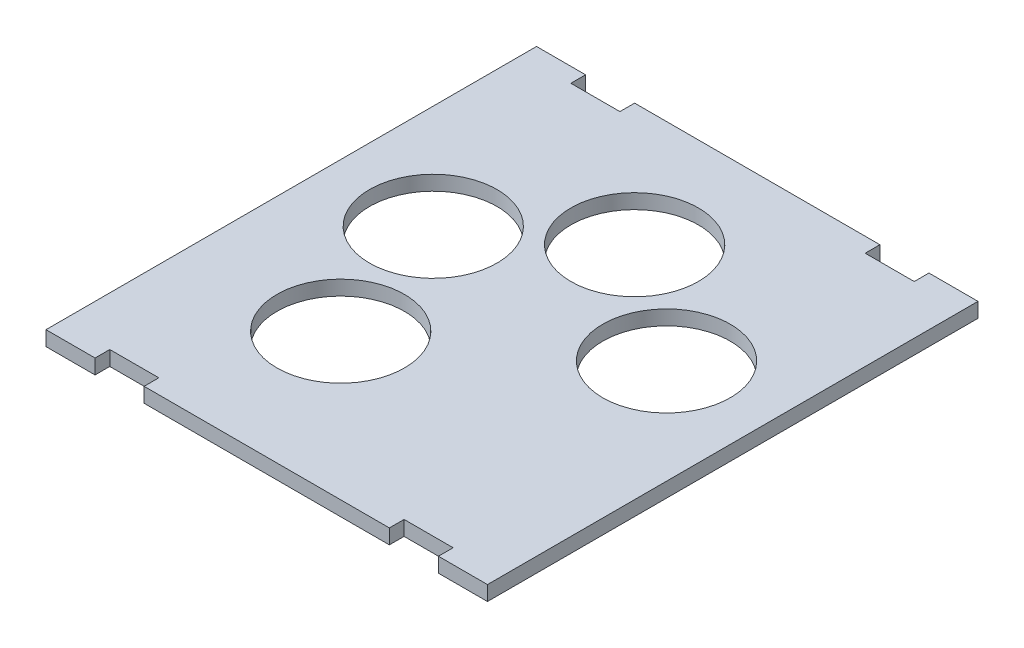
ISO-10303-21;
HEADER;
FILE_DESCRIPTION(('STEP AP214'),'2;1');
FILE_NAME('part.step','',(''),(''),'','','');
FILE_SCHEMA(('AUTOMOTIVE_DESIGN { 1 0 10303 214 1 1 1 1 }'));
ENDSEC;
DATA;
#1=APPLICATION_CONTEXT('core data for automotive mechanical design processes');
#2=APPLICATION_PROTOCOL_DEFINITION('international standard','automotive_design',2000,#1);
#3=PRODUCT_CONTEXT('',#1,'mechanical');
#4=PRODUCT('Part','Part','',(#3));
#5=PRODUCT_RELATED_PRODUCT_CATEGORY('part','',(#4));
#6=PRODUCT_DEFINITION_FORMATION('','',#4);
#7=PRODUCT_DEFINITION_CONTEXT('part definition',#1,'design');
#8=PRODUCT_DEFINITION('design','',#6,#7);
#9=PRODUCT_DEFINITION_SHAPE('','',#8);
#10=(LENGTH_UNIT() NAMED_UNIT(*) SI_UNIT(.MILLI.,.METRE.));
#11=(NAMED_UNIT(*) PLANE_ANGLE_UNIT() SI_UNIT($,.RADIAN.));
#12=(NAMED_UNIT(*) SI_UNIT($,.STERADIAN.) SOLID_ANGLE_UNIT());
#13=UNCERTAINTY_MEASURE_WITH_UNIT(LENGTH_MEASURE(1.E-05),#10,'distance_accuracy_value','');
#14=(GEOMETRIC_REPRESENTATION_CONTEXT(3) GLOBAL_UNCERTAINTY_ASSIGNED_CONTEXT((#13)) GLOBAL_UNIT_ASSIGNED_CONTEXT((#10,
#11,#12)) REPRESENTATION_CONTEXT('',''));
#15=CARTESIAN_POINT('',(0.,0.,0.));
#16=DIRECTION('',(0.,0.,1.));
#17=DIRECTION('',(1.,0.,0.));
#18=AXIS2_PLACEMENT_3D('',#15,#16,#17);
#19=CARTESIAN_POINT('',(45.,3.,-50.));
#20=DIRECTION('',(0.,0.,1.));
#21=DIRECTION('',(1.,0.,0.));
#22=AXIS2_PLACEMENT_3D('',#19,#20,#21);
#23=PLANE('',#22);
#24=DIRECTION('',(-1.,0.,0.));
#25=VECTOR('',#24,1.);
#26=CARTESIAN_POINT('',(45.,0.,-50.));
#27=LINE('',#26,#25);
#28=CARTESIAN_POINT('',(45.,0.,-50.));
#29=VERTEX_POINT('',#28);
#30=CARTESIAN_POINT('',(35.,0.,-50.));
#31=VERTEX_POINT('',#30);
#32=EDGE_CURVE('E320',#29,#31,#27,.T.);
#33=ORIENTED_EDGE('',*,*,#32,.T.);
#34=DIRECTION('',(0.,1.,0.));
#35=VECTOR('',#34,1.);
#36=CARTESIAN_POINT('',(35.,0.,-50.));
#37=LINE('',#36,#35);
#38=CARTESIAN_POINT('',(35.,3.,-50.));
#39=VERTEX_POINT('',#38);
#40=EDGE_CURVE('E202',#31,#39,#37,.T.);
#41=ORIENTED_EDGE('',*,*,#40,.T.);
#42=DIRECTION('',(-1.,0.,0.));
#43=VECTOR('',#42,1.);
#44=CARTESIAN_POINT('',(45.,3.,-50.));
#45=LINE('',#44,#43);
#46=CARTESIAN_POINT('',(45.,3.,-50.));
#47=VERTEX_POINT('',#46);
#48=EDGE_CURVE('E305',#47,#39,#45,.T.);
#49=ORIENTED_EDGE('',*,*,#48,.F.);
#50=DIRECTION('',(0.,-1.,0.));
#51=VECTOR('',#50,1.);
#52=CARTESIAN_POINT('',(45.,3.,-50.));
#53=LINE('',#52,#51);
#54=EDGE_CURVE('E319',#47,#29,#53,.T.);
#55=ORIENTED_EDGE('',*,*,#54,.T.);
#56=EDGE_LOOP('',(#33,#41,#49,#55));
#57=FACE_BOUND('',#56,.T.);
#58=ADVANCED_FACE('F32',(#57),#23,.F.);
#59=CARTESIAN_POINT('',(25.,3.,-50.));
#60=VERTEX_POINT('',#59);
#61=CARTESIAN_POINT('',(-25.,3.,-50.));
#62=VERTEX_POINT('',#61);
#63=EDGE_CURVE('E309',#60,#62,#45,.T.);
#64=ORIENTED_EDGE('',*,*,#63,.F.);
#65=DIRECTION('',(0.,1.,0.));
#66=VECTOR('',#65,1.);
#67=CARTESIAN_POINT('',(25.,0.,-50.));
#68=LINE('',#67,#66);
#69=CARTESIAN_POINT('',(25.,0.,-50.));
#70=VERTEX_POINT('',#69);
#71=EDGE_CURVE('E176',#70,#60,#68,.T.);
#72=ORIENTED_EDGE('',*,*,#71,.F.);
#73=CARTESIAN_POINT('',(-25.,0.,-50.));
#74=VERTEX_POINT('',#73);
#75=EDGE_CURVE('E192',#70,#74,#27,.T.);
#76=ORIENTED_EDGE('',*,*,#75,.T.);
#77=DIRECTION('',(0.,1.,0.));
#78=VECTOR('',#77,1.);
#79=CARTESIAN_POINT('',(-25.,0.,-50.));
#80=LINE('',#79,#78);
#81=EDGE_CURVE('E272',#74,#62,#80,.T.);
#82=ORIENTED_EDGE('',*,*,#81,.T.);
#83=EDGE_LOOP('',(#64,#72,#76,#82));
#84=FACE_BOUND('',#83,.T.);
#85=ADVANCED_FACE('F362',(#84),#23,.F.);
#86=CARTESIAN_POINT('',(-45.,3.,50.));
#87=DIRECTION('',(0.,0.,-1.));
#88=DIRECTION('',(-1.,0.,0.));
#89=AXIS2_PLACEMENT_3D('',#86,#87,#88);
#90=PLANE('',#89);
#91=DIRECTION('',(1.,0.,0.));
#92=VECTOR('',#91,1.);
#93=CARTESIAN_POINT('',(-45.,0.,50.));
#94=LINE('',#93,#92);
#95=CARTESIAN_POINT('',(-45.,0.,50.));
#96=VERTEX_POINT('',#95);
#97=CARTESIAN_POINT('',(-35.,0.,50.));
#98=VERTEX_POINT('',#97);
#99=EDGE_CURVE('E326',#96,#98,#94,.T.);
#100=ORIENTED_EDGE('',*,*,#99,.T.);
#101=DIRECTION('',(0.,1.,0.));
#102=VECTOR('',#101,1.);
#103=CARTESIAN_POINT('',(-35.,0.,50.));
#104=LINE('',#103,#102);
#105=CARTESIAN_POINT('',(-35.,3.,50.));
#106=VERTEX_POINT('',#105);
#107=EDGE_CURVE('E243',#98,#106,#104,.T.);
#108=ORIENTED_EDGE('',*,*,#107,.T.);
#109=DIRECTION('',(1.,0.,0.));
#110=VECTOR('',#109,1.);
#111=CARTESIAN_POINT('',(-45.,3.,50.));
#112=LINE('',#111,#110);
#113=CARTESIAN_POINT('',(-45.,3.,50.));
#114=VERTEX_POINT('',#113);
#115=EDGE_CURVE('E313',#114,#106,#112,.T.);
#116=ORIENTED_EDGE('',*,*,#115,.F.);
#117=DIRECTION('',(0.,-1.,0.));
#118=VECTOR('',#117,1.);
#119=CARTESIAN_POINT('',(-45.,3.,50.));
#120=LINE('',#119,#118);
#121=EDGE_CURVE('E40',#114,#96,#120,.T.);
#122=ORIENTED_EDGE('',*,*,#121,.T.);
#123=EDGE_LOOP('',(#100,#108,#116,#122));
#124=FACE_BOUND('',#123,.T.);
#125=ADVANCED_FACE('F341',(#124),#90,.F.);
#126=CARTESIAN_POINT('',(-25.,3.,50.));
#127=VERTEX_POINT('',#126);
#128=CARTESIAN_POINT('',(25.,3.,50.));
#129=VERTEX_POINT('',#128);
#130=EDGE_CURVE('E317',#127,#129,#112,.T.);
#131=ORIENTED_EDGE('',*,*,#130,.F.);
#132=DIRECTION('',(0.,1.,0.));
#133=VECTOR('',#132,1.);
#134=CARTESIAN_POINT('',(-25.,0.,50.));
#135=LINE('',#134,#133);
#136=CARTESIAN_POINT('',(-25.,0.,50.));
#137=VERTEX_POINT('',#136);
#138=EDGE_CURVE('E254',#137,#127,#135,.T.);
#139=ORIENTED_EDGE('',*,*,#138,.F.);
#140=CARTESIAN_POINT('',(25.,0.,50.));
#141=VERTEX_POINT('',#140);
#142=EDGE_CURVE('E330',#137,#141,#94,.T.);
#143=ORIENTED_EDGE('',*,*,#142,.T.);
#144=DIRECTION('',(0.,1.,0.));
#145=VECTOR('',#144,1.);
#146=CARTESIAN_POINT('',(25.,0.,50.));
#147=LINE('',#146,#145);
#148=EDGE_CURVE('E200',#141,#129,#147,.T.);
#149=ORIENTED_EDGE('',*,*,#148,.T.);
#150=EDGE_LOOP('',(#131,#139,#143,#149));
#151=FACE_BOUND('',#150,.T.);
#152=ADVANCED_FACE('F387',(#151),#90,.F.);
#153=CARTESIAN_POINT('',(0.,3.,0.));
#154=DIRECTION('',(0.,1.,0.));
#155=DIRECTION('',(0.,0.,1.));
#156=AXIS2_PLACEMENT_3D('',#153,#154,#155);
#157=PLANE('',#156);
#158=DIRECTION('',(0.,0.,1.));
#159=VECTOR('',#158,1.);
#160=CARTESIAN_POINT('',(-35.,3.,50.));
#161=LINE('',#160,#159);
#162=CARTESIAN_POINT('',(-35.,3.,47.));
#163=VERTEX_POINT('',#162);
#164=EDGE_CURVE('E244',#163,#106,#161,.T.);
#165=ORIENTED_EDGE('',*,*,#164,.F.);
#166=DIRECTION('',(-1.,0.,0.));
#167=VECTOR('',#166,1.);
#168=CARTESIAN_POINT('',(-35.,3.,47.));
#169=LINE('',#168,#167);
#170=CARTESIAN_POINT('',(-25.,3.,47.));
#171=VERTEX_POINT('',#170);
#172=EDGE_CURVE('E238',#171,#163,#169,.T.);
#173=ORIENTED_EDGE('',*,*,#172,.F.);
#174=DIRECTION('',(0.,0.,-1.));
#175=VECTOR('',#174,1.);
#176=CARTESIAN_POINT('',(-25.,3.,47.));
#177=LINE('',#176,#175);
#178=EDGE_CURVE('E246',#127,#171,#177,.T.);
#179=ORIENTED_EDGE('',*,*,#178,.F.);
#180=ORIENTED_EDGE('',*,*,#130,.T.);
#181=DIRECTION('',(0.,0.,1.));
#182=VECTOR('',#181,1.);
#183=CARTESIAN_POINT('',(25.,3.,50.));
#184=LINE('',#183,#182);
#185=CARTESIAN_POINT('',(25.,3.,47.));
#186=VERTEX_POINT('',#185);
#187=EDGE_CURVE('E212',#186,#129,#184,.T.);
#188=ORIENTED_EDGE('',*,*,#187,.F.);
#189=DIRECTION('',(-1.,0.,0.));
#190=VECTOR('',#189,1.);
#191=CARTESIAN_POINT('',(25.,3.,47.));
#192=LINE('',#191,#190);
#193=CARTESIAN_POINT('',(35.,3.,47.));
#194=VERTEX_POINT('',#193);
#195=EDGE_CURVE('E222',#194,#186,#192,.T.);
#196=ORIENTED_EDGE('',*,*,#195,.F.);
#197=DIRECTION('',(0.,0.,-1.));
#198=VECTOR('',#197,1.);
#199=CARTESIAN_POINT('',(35.,3.,47.));
#200=LINE('',#199,#198);
#201=CARTESIAN_POINT('',(35.,3.,50.));
#202=VERTEX_POINT('',#201);
#203=EDGE_CURVE('E219',#202,#194,#200,.T.);
#204=ORIENTED_EDGE('',*,*,#203,.F.);
#205=CARTESIAN_POINT('',(45.,3.,50.));
#206=VERTEX_POINT('',#205);
#207=EDGE_CURVE('E312',#202,#206,#112,.T.);
#208=ORIENTED_EDGE('',*,*,#207,.T.);
#209=DIRECTION('',(0.,0.,-1.));
#210=VECTOR('',#209,1.);
#211=CARTESIAN_POINT('',(45.,3.,50.));
#212=LINE('',#211,#210);
#213=EDGE_CURVE('E316',#206,#47,#212,.T.);
#214=ORIENTED_EDGE('',*,*,#213,.T.);
#215=ORIENTED_EDGE('',*,*,#48,.T.);
#216=DIRECTION('',(0.,0.,-1.));
#217=VECTOR('',#216,1.);
#218=CARTESIAN_POINT('',(35.,3.,-47.));
#219=LINE('',#218,#217);
#220=CARTESIAN_POINT('',(35.,3.,-47.));
#221=VERTEX_POINT('',#220);
#222=EDGE_CURVE('E193',#221,#39,#219,.T.);
#223=ORIENTED_EDGE('',*,*,#222,.F.);
#224=DIRECTION('',(1.,0.,0.));
#225=VECTOR('',#224,1.);
#226=CARTESIAN_POINT('',(25.,3.,-47.));
#227=LINE('',#226,#225);
#228=CARTESIAN_POINT('',(25.,3.,-47.));
#229=VERTEX_POINT('',#228);
#230=EDGE_CURVE('E195',#229,#221,#227,.T.);
#231=ORIENTED_EDGE('',*,*,#230,.F.);
#232=DIRECTION('',(0.,0.,1.));
#233=VECTOR('',#232,1.);
#234=CARTESIAN_POINT('',(25.,3.,-50.));
#235=LINE('',#234,#233);
#236=EDGE_CURVE('E171',#60,#229,#235,.T.);
#237=ORIENTED_EDGE('',*,*,#236,.F.);
#238=ORIENTED_EDGE('',*,*,#63,.T.);
#239=DIRECTION('',(0.,0.,-1.));
#240=VECTOR('',#239,1.);
#241=CARTESIAN_POINT('',(-25.,3.,-47.));
#242=LINE('',#241,#240);
#243=CARTESIAN_POINT('',(-25.,3.,-47.));
#244=VERTEX_POINT('',#243);
#245=EDGE_CURVE('E260',#244,#62,#242,.T.);
#246=ORIENTED_EDGE('',*,*,#245,.F.);
#247=DIRECTION('',(1.,0.,0.));
#248=VECTOR('',#247,1.);
#249=CARTESIAN_POINT('',(-35.,3.,-47.));
#250=LINE('',#249,#248);
#251=CARTESIAN_POINT('',(-35.,3.,-47.));
#252=VERTEX_POINT('',#251);
#253=EDGE_CURVE('E268',#252,#244,#250,.T.);
#254=ORIENTED_EDGE('',*,*,#253,.F.);
#255=DIRECTION('',(0.,0.,1.));
#256=VECTOR('',#255,1.);
#257=CARTESIAN_POINT('',(-35.,3.,-50.));
#258=LINE('',#257,#256);
#259=CARTESIAN_POINT('',(-35.,3.,-50.));
#260=VERTEX_POINT('',#259);
#261=EDGE_CURVE('E205',#260,#252,#258,.T.);
#262=ORIENTED_EDGE('',*,*,#261,.F.);
#263=CARTESIAN_POINT('',(-45.,3.,-50.));
#264=VERTEX_POINT('',#263);
#265=EDGE_CURVE('E310',#260,#264,#45,.T.);
#266=ORIENTED_EDGE('',*,*,#265,.T.);
#267=DIRECTION('',(0.,0.,1.));
#268=VECTOR('',#267,1.);
#269=CARTESIAN_POINT('',(-45.,3.,-50.));
#270=LINE('',#269,#268);
#271=EDGE_CURVE('E308',#264,#114,#270,.T.);
#272=ORIENTED_EDGE('',*,*,#271,.T.);
#273=ORIENTED_EDGE('',*,*,#115,.T.);
#274=EDGE_LOOP('',(#165,#173,#179,#180,#188,#196,#204,#208,#214,#215,#223,#231,#237,#238,#246,
#254,#262,#266,#272,#273));
#275=FACE_BOUND('',#274,.T.);
#276=CARTESIAN_POINT('',(-14.6946313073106,3.,20.2254248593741));
#277=DIRECTION('',(0.,1.,0.));
#278=DIRECTION('',(0.,0.,1.));
#279=AXIS2_PLACEMENT_3D('',#276,#277,#278);
#280=CIRCLE('',#279,13.0000000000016);
#281=CARTESIAN_POINT('',(-14.6946313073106,3.,33.2254248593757));
#282=VERTEX_POINT('',#281);
#283=EDGE_CURVE('E287',#282,#282,#280,.T.);
#284=ORIENTED_EDGE('',*,*,#283,.F.);
#285=EDGE_LOOP('',(#284));
#286=FACE_BOUND('',#285,.T.);
#287=CARTESIAN_POINT('',(0.,3.,-25.));
#288=DIRECTION('',(0.,1.,0.));
#289=DIRECTION('',(0.,0.,1.));
#290=AXIS2_PLACEMENT_3D('',#287,#288,#289);
#291=CIRCLE('',#290,13.);
#292=CARTESIAN_POINT('',(0.,3.,-12.));
#293=VERTEX_POINT('',#292);
#294=EDGE_CURVE('E299',#293,#293,#291,.T.);
#295=ORIENTED_EDGE('',*,*,#294,.F.);
#296=EDGE_LOOP('',(#295));
#297=FACE_BOUND('',#296,.T.);
#298=CARTESIAN_POINT('',(23.7764129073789,3.,-7.72542485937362));
#299=DIRECTION('',(0.,1.,0.));
#300=DIRECTION('',(0.,0.,1.));
#301=AXIS2_PLACEMENT_3D('',#298,#299,#300);
#302=CIRCLE('',#301,13.);
#303=CARTESIAN_POINT('',(23.7764129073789,3.,5.27457514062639));
#304=VERTEX_POINT('',#303);
#305=EDGE_CURVE('E293',#304,#304,#302,.T.);
#306=ORIENTED_EDGE('',*,*,#305,.F.);
#307=EDGE_LOOP('',(#306));
#308=FACE_BOUND('',#307,.T.);
#309=CARTESIAN_POINT('',(-23.7764129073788,3.,-7.72542485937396));
#310=DIRECTION('',(0.,1.,0.));
#311=DIRECTION('',(0.,0.,1.));
#312=AXIS2_PLACEMENT_3D('',#309,#310,#311);
#313=CIRCLE('',#312,13.);
#314=CARTESIAN_POINT('',(-23.7764129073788,3.,5.27457514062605));
#315=VERTEX_POINT('',#314);
#316=EDGE_CURVE('E281',#315,#315,#313,.T.);
#317=ORIENTED_EDGE('',*,*,#316,.F.);
#318=EDGE_LOOP('',(#317));
#319=FACE_BOUND('',#318,.T.);
#320=ADVANCED_FACE('F352',(#275,#286,#297,#308,#319),#157,.T.);
#321=CARTESIAN_POINT('',(0.,0.,0.));
#322=DIRECTION('',(0.,1.,0.));
#323=DIRECTION('',(0.,0.,1.));
#324=AXIS2_PLACEMENT_3D('',#321,#322,#323);
#325=PLANE('',#324);
#326=DIRECTION('',(-1.,0.,0.));
#327=VECTOR('',#326,1.);
#328=CARTESIAN_POINT('',(-35.,0.,47.));
#329=LINE('',#328,#327);
#330=CARTESIAN_POINT('',(-25.,0.,47.));
#331=VERTEX_POINT('',#330);
#332=CARTESIAN_POINT('',(-35.,0.,47.));
#333=VERTEX_POINT('',#332);
#334=EDGE_CURVE('E241',#331,#333,#329,.T.);
#335=ORIENTED_EDGE('',*,*,#334,.T.);
#336=DIRECTION('',(0.,0.,1.));
#337=VECTOR('',#336,1.);
#338=CARTESIAN_POINT('',(-35.,0.,50.));
#339=LINE('',#338,#337);
#340=EDGE_CURVE('E234',#333,#98,#339,.T.);
#341=ORIENTED_EDGE('',*,*,#340,.T.);
#342=ORIENTED_EDGE('',*,*,#99,.F.);
#343=DIRECTION('',(0.,0.,1.));
#344=VECTOR('',#343,1.);
#345=CARTESIAN_POINT('',(-45.,0.,-50.));
#346=LINE('',#345,#344);
#347=CARTESIAN_POINT('',(-45.,0.,-50.));
#348=VERTEX_POINT('',#347);
#349=EDGE_CURVE('E323',#348,#96,#346,.T.);
#350=ORIENTED_EDGE('',*,*,#349,.F.);
#351=CARTESIAN_POINT('',(-35.,0.,-50.));
#352=VERTEX_POINT('',#351);
#353=EDGE_CURVE('E302',#352,#348,#27,.T.);
#354=ORIENTED_EDGE('',*,*,#353,.F.);
#355=DIRECTION('',(0.,0.,1.));
#356=VECTOR('',#355,1.);
#357=CARTESIAN_POINT('',(-35.,0.,-50.));
#358=LINE('',#357,#356);
#359=CARTESIAN_POINT('',(-35.,0.,-47.));
#360=VERTEX_POINT('',#359);
#361=EDGE_CURVE('E47',#352,#360,#358,.T.);
#362=ORIENTED_EDGE('',*,*,#361,.T.);
#363=DIRECTION('',(1.,0.,0.));
#364=VECTOR('',#363,1.);
#365=CARTESIAN_POINT('',(-35.,0.,-47.));
#366=LINE('',#365,#364);
#367=CARTESIAN_POINT('',(-25.,0.,-47.));
#368=VERTEX_POINT('',#367);
#369=EDGE_CURVE('E259',#360,#368,#366,.T.);
#370=ORIENTED_EDGE('',*,*,#369,.T.);
#371=DIRECTION('',(0.,0.,-1.));
#372=VECTOR('',#371,1.);
#373=CARTESIAN_POINT('',(-25.,0.,-47.));
#374=LINE('',#373,#372);
#375=EDGE_CURVE('E263',#368,#74,#374,.T.);
#376=ORIENTED_EDGE('',*,*,#375,.T.);
#377=ORIENTED_EDGE('',*,*,#75,.F.);
#378=DIRECTION('',(0.,0.,1.));
#379=VECTOR('',#378,1.);
#380=CARTESIAN_POINT('',(25.,0.,-50.));
#381=LINE('',#380,#379);
#382=CARTESIAN_POINT('',(25.,0.,-47.));
#383=VERTEX_POINT('',#382);
#384=EDGE_CURVE('E55',#70,#383,#381,.T.);
#385=ORIENTED_EDGE('',*,*,#384,.T.);
#386=DIRECTION('',(1.,0.,0.));
#387=VECTOR('',#386,1.);
#388=CARTESIAN_POINT('',(25.,0.,-47.));
#389=LINE('',#388,#387);
#390=CARTESIAN_POINT('',(35.,0.,-47.));
#391=VERTEX_POINT('',#390);
#392=EDGE_CURVE('E179',#383,#391,#389,.T.);
#393=ORIENTED_EDGE('',*,*,#392,.T.);
#394=DIRECTION('',(0.,0.,-1.));
#395=VECTOR('',#394,1.);
#396=CARTESIAN_POINT('',(35.,0.,-47.));
#397=LINE('',#396,#395);
#398=EDGE_CURVE('E184',#391,#31,#397,.T.);
#399=ORIENTED_EDGE('',*,*,#398,.T.);
#400=ORIENTED_EDGE('',*,*,#32,.F.);
#401=DIRECTION('',(0.,0.,-1.));
#402=VECTOR('',#401,1.);
#403=CARTESIAN_POINT('',(45.,0.,50.));
#404=LINE('',#403,#402);
#405=CARTESIAN_POINT('',(45.,0.,50.));
#406=VERTEX_POINT('',#405);
#407=EDGE_CURVE('E329',#406,#29,#404,.T.);
#408=ORIENTED_EDGE('',*,*,#407,.F.);
#409=CARTESIAN_POINT('',(35.,0.,50.));
#410=VERTEX_POINT('',#409);
#411=EDGE_CURVE('E325',#410,#406,#94,.T.);
#412=ORIENTED_EDGE('',*,*,#411,.F.);
#413=DIRECTION('',(0.,0.,-1.));
#414=VECTOR('',#413,1.);
#415=CARTESIAN_POINT('',(35.,0.,47.));
#416=LINE('',#415,#414);
#417=CARTESIAN_POINT('',(35.,0.,47.));
#418=VERTEX_POINT('',#417);
#419=EDGE_CURVE('E208',#410,#418,#416,.T.);
#420=ORIENTED_EDGE('',*,*,#419,.T.);
#421=DIRECTION('',(-1.,0.,0.));
#422=VECTOR('',#421,1.);
#423=CARTESIAN_POINT('',(25.,0.,47.));
#424=LINE('',#423,#422);
#425=CARTESIAN_POINT('',(25.,0.,47.));
#426=VERTEX_POINT('',#425);
#427=EDGE_CURVE('E211',#418,#426,#424,.T.);
#428=ORIENTED_EDGE('',*,*,#427,.T.);
#429=DIRECTION('',(0.,0.,1.));
#430=VECTOR('',#429,1.);
#431=CARTESIAN_POINT('',(25.,0.,50.));
#432=LINE('',#431,#430);
#433=EDGE_CURVE('E215',#426,#141,#432,.T.);
#434=ORIENTED_EDGE('',*,*,#433,.T.);
#435=ORIENTED_EDGE('',*,*,#142,.F.);
#436=DIRECTION('',(0.,0.,-1.));
#437=VECTOR('',#436,1.);
#438=CARTESIAN_POINT('',(-25.,0.,47.));
#439=LINE('',#438,#437);
#440=EDGE_CURVE('E237',#137,#331,#439,.T.);
#441=ORIENTED_EDGE('',*,*,#440,.T.);
#442=EDGE_LOOP('',(#335,#341,#342,#350,#354,#362,#370,#376,#377,#385,#393,#399,#400,#408,#412,
#420,#428,#434,#435,#441));
#443=FACE_BOUND('',#442,.T.);
#444=CARTESIAN_POINT('',(0.,0.,-25.));
#445=DIRECTION('',(0.,1.,0.));
#446=DIRECTION('',(0.,0.,1.));
#447=AXIS2_PLACEMENT_3D('',#444,#445,#446);
#448=CIRCLE('',#447,13.);
#449=CARTESIAN_POINT('',(0.,0.,-12.));
#450=VERTEX_POINT('',#449);
#451=EDGE_CURVE('E296',#450,#450,#448,.T.);
#452=ORIENTED_EDGE('',*,*,#451,.T.);
#453=EDGE_LOOP('',(#452));
#454=FACE_BOUND('',#453,.T.);
#455=CARTESIAN_POINT('',(23.7764129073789,0.,-7.72542485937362));
#456=DIRECTION('',(0.,1.,0.));
#457=DIRECTION('',(0.,0.,1.));
#458=AXIS2_PLACEMENT_3D('',#455,#456,#457);
#459=CIRCLE('',#458,13.);
#460=CARTESIAN_POINT('',(23.7764129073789,0.,5.27457514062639));
#461=VERTEX_POINT('',#460);
#462=EDGE_CURVE('E290',#461,#461,#459,.T.);
#463=ORIENTED_EDGE('',*,*,#462,.T.);
#464=EDGE_LOOP('',(#463));
#465=FACE_BOUND('',#464,.T.);
#466=CARTESIAN_POINT('',(-14.6946313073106,0.,20.2254248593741));
#467=DIRECTION('',(0.,1.,0.));
#468=DIRECTION('',(0.,0.,1.));
#469=AXIS2_PLACEMENT_3D('',#466,#467,#468);
#470=CIRCLE('',#469,13.0000000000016);
#471=CARTESIAN_POINT('',(-14.6946313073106,0.,33.2254248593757));
#472=VERTEX_POINT('',#471);
#473=EDGE_CURVE('E284',#472,#472,#470,.T.);
#474=ORIENTED_EDGE('',*,*,#473,.T.);
#475=EDGE_LOOP('',(#474));
#476=FACE_BOUND('',#475,.T.);
#477=CARTESIAN_POINT('',(-23.7764129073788,0.,-7.72542485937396));
#478=DIRECTION('',(0.,1.,0.));
#479=DIRECTION('',(0.,0.,1.));
#480=AXIS2_PLACEMENT_3D('',#477,#478,#479);
#481=CIRCLE('',#480,13.);
#482=CARTESIAN_POINT('',(-23.7764129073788,0.,5.27457514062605));
#483=VERTEX_POINT('',#482);
#484=EDGE_CURVE('E275',#483,#483,#481,.T.);
#485=ORIENTED_EDGE('',*,*,#484,.T.);
#486=EDGE_LOOP('',(#485));
#487=FACE_BOUND('',#486,.T.);
#488=ADVANCED_FACE('F188',(#443,#454,#465,#476,#487),#325,.F.);
#489=ORIENTED_EDGE('',*,*,#265,.F.);
#490=DIRECTION('',(0.,1.,0.));
#491=VECTOR('',#490,1.);
#492=CARTESIAN_POINT('',(-35.,0.,-50.));
#493=LINE('',#492,#491);
#494=EDGE_CURVE('E265',#352,#260,#493,.T.);
#495=ORIENTED_EDGE('',*,*,#494,.F.);
#496=ORIENTED_EDGE('',*,*,#353,.T.);
#497=DIRECTION('',(0.,-1.,0.));
#498=VECTOR('',#497,1.);
#499=CARTESIAN_POINT('',(-45.,3.,-50.));
#500=LINE('',#499,#498);
#501=EDGE_CURVE('E11',#264,#348,#500,.T.);
#502=ORIENTED_EDGE('',*,*,#501,.F.);
#503=EDGE_LOOP('',(#489,#495,#496,#502));
#504=FACE_BOUND('',#503,.T.);
#505=ADVANCED_FACE('F34',(#504),#23,.F.);
#506=CARTESIAN_POINT('',(-45.,3.,-50.));
#507=DIRECTION('',(1.,0.,0.));
#508=DIRECTION('',(0.,0.,-1.));
#509=AXIS2_PLACEMENT_3D('',#506,#507,#508);
#510=PLANE('',#509);
#511=ORIENTED_EDGE('',*,*,#349,.T.);
#512=ORIENTED_EDGE('',*,*,#121,.F.);
#513=ORIENTED_EDGE('',*,*,#271,.F.);
#514=ORIENTED_EDGE('',*,*,#501,.T.);
#515=EDGE_LOOP('',(#511,#512,#513,#514));
#516=FACE_BOUND('',#515,.T.);
#517=ADVANCED_FACE('F358',(#516),#510,.F.);
#518=ORIENTED_EDGE('',*,*,#207,.F.);
#519=DIRECTION('',(0.,1.,0.));
#520=VECTOR('',#519,1.);
#521=CARTESIAN_POINT('',(35.,0.,50.));
#522=LINE('',#521,#520);
#523=EDGE_CURVE('E218',#410,#202,#522,.T.);
#524=ORIENTED_EDGE('',*,*,#523,.F.);
#525=ORIENTED_EDGE('',*,*,#411,.T.);
#526=DIRECTION('',(0.,-1.,0.));
#527=VECTOR('',#526,1.);
#528=CARTESIAN_POINT('',(45.,3.,50.));
#529=LINE('',#528,#527);
#530=EDGE_CURVE('E334',#206,#406,#529,.T.);
#531=ORIENTED_EDGE('',*,*,#530,.F.);
#532=EDGE_LOOP('',(#518,#524,#525,#531));
#533=FACE_BOUND('',#532,.T.);
#534=ADVANCED_FACE('F380',(#533),#90,.F.);
#535=CARTESIAN_POINT('',(45.,3.,50.));
#536=DIRECTION('',(-1.,0.,0.));
#537=DIRECTION('',(0.,0.,1.));
#538=AXIS2_PLACEMENT_3D('',#535,#536,#537);
#539=PLANE('',#538);
#540=ORIENTED_EDGE('',*,*,#407,.T.);
#541=ORIENTED_EDGE('',*,*,#54,.F.);
#542=ORIENTED_EDGE('',*,*,#213,.F.);
#543=ORIENTED_EDGE('',*,*,#530,.T.);
#544=EDGE_LOOP('',(#540,#541,#542,#543));
#545=FACE_BOUND('',#544,.T.);
#546=ADVANCED_FACE('F375',(#545),#539,.F.);
#547=CARTESIAN_POINT('',(0.,3.,-25.));
#548=DIRECTION('',(0.,-1.,0.));
#549=DIRECTION('',(0.,0.,-1.));
#550=AXIS2_PLACEMENT_3D('',#547,#548,#549);
#551=CYLINDRICAL_SURFACE('',#550,13.);
#552=ORIENTED_EDGE('',*,*,#294,.T.);
#553=EDGE_LOOP('',(#552));
#554=FACE_BOUND('',#553,.T.);
#555=ORIENTED_EDGE('',*,*,#451,.F.);
#556=EDGE_LOOP('',(#555));
#557=FACE_BOUND('',#556,.T.);
#558=ADVANCED_FACE('F428',(#554,#557),#551,.F.);
#559=CARTESIAN_POINT('',(23.7764129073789,3.,-7.72542485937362));
#560=DIRECTION('',(0.,-1.,0.));
#561=DIRECTION('',(0.,0.,-1.));
#562=AXIS2_PLACEMENT_3D('',#559,#560,#561);
#563=CYLINDRICAL_SURFACE('',#562,13.);
#564=ORIENTED_EDGE('',*,*,#305,.T.);
#565=EDGE_LOOP('',(#564));
#566=FACE_BOUND('',#565,.T.);
#567=ORIENTED_EDGE('',*,*,#462,.F.);
#568=EDGE_LOOP('',(#567));
#569=FACE_BOUND('',#568,.T.);
#570=ADVANCED_FACE('F565',(#566,#569),#563,.F.);
#571=CARTESIAN_POINT('',(-14.6946313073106,3.,20.2254248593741));
#572=DIRECTION('',(0.,-1.,0.));
#573=DIRECTION('',(0.,0.,-1.));
#574=AXIS2_PLACEMENT_3D('',#571,#572,#573);
#575=CYLINDRICAL_SURFACE('',#574,13.0000000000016);
#576=ORIENTED_EDGE('',*,*,#283,.T.);
#577=EDGE_LOOP('',(#576));
#578=FACE_BOUND('',#577,.T.);
#579=ORIENTED_EDGE('',*,*,#473,.F.);
#580=EDGE_LOOP('',(#579));
#581=FACE_BOUND('',#580,.T.);
#582=ADVANCED_FACE('F561',(#578,#581),#575,.F.);
#583=CARTESIAN_POINT('',(-23.7764129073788,3.,-7.72542485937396));
#584=DIRECTION('',(0.,-1.,0.));
#585=DIRECTION('',(0.,0.,-1.));
#586=AXIS2_PLACEMENT_3D('',#583,#584,#585);
#587=CYLINDRICAL_SURFACE('',#586,13.);
#588=ORIENTED_EDGE('',*,*,#316,.T.);
#589=EDGE_LOOP('',(#588));
#590=FACE_BOUND('',#589,.T.);
#591=ORIENTED_EDGE('',*,*,#484,.F.);
#592=EDGE_LOOP('',(#591));
#593=FACE_BOUND('',#592,.T.);
#594=ADVANCED_FACE('F408',(#590,#593),#587,.F.);
#595=CARTESIAN_POINT('',(25.,0.,50.));
#596=DIRECTION('',(-1.,0.,0.));
#597=DIRECTION('',(0.,0.,1.));
#598=AXIS2_PLACEMENT_3D('',#595,#596,#597);
#599=PLANE('',#598);
#600=ORIENTED_EDGE('',*,*,#187,.T.);
#601=ORIENTED_EDGE('',*,*,#148,.F.);
#602=ORIENTED_EDGE('',*,*,#433,.F.);
#603=DIRECTION('',(0.,1.,0.));
#604=VECTOR('',#603,1.);
#605=CARTESIAN_POINT('',(25.,0.,47.));
#606=LINE('',#605,#604);
#607=EDGE_CURVE('E229',#426,#186,#606,.T.);
#608=ORIENTED_EDGE('',*,*,#607,.T.);
#609=EDGE_LOOP('',(#600,#601,#602,#608));
#610=FACE_BOUND('',#609,.T.);
#611=ADVANCED_FACE('F392',(#610),#599,.F.);
#612=CARTESIAN_POINT('',(25.,0.,47.));
#613=DIRECTION('',(0.,0.,-1.));
#614=DIRECTION('',(-1.,0.,0.));
#615=AXIS2_PLACEMENT_3D('',#612,#613,#614);
#616=PLANE('',#615);
#617=ORIENTED_EDGE('',*,*,#195,.T.);
#618=ORIENTED_EDGE('',*,*,#607,.F.);
#619=ORIENTED_EDGE('',*,*,#427,.F.);
#620=DIRECTION('',(0.,1.,0.));
#621=VECTOR('',#620,1.);
#622=CARTESIAN_POINT('',(35.,0.,47.));
#623=LINE('',#622,#621);
#624=EDGE_CURVE('E231',#418,#194,#623,.T.);
#625=ORIENTED_EDGE('',*,*,#624,.T.);
#626=EDGE_LOOP('',(#617,#618,#619,#625));
#627=FACE_BOUND('',#626,.T.);
#628=ADVANCED_FACE('F400',(#627),#616,.F.);
#629=CARTESIAN_POINT('',(35.,0.,47.));
#630=DIRECTION('',(1.,0.,0.));
#631=DIRECTION('',(0.,0.,-1.));
#632=AXIS2_PLACEMENT_3D('',#629,#630,#631);
#633=PLANE('',#632);
#634=ORIENTED_EDGE('',*,*,#203,.T.);
#635=ORIENTED_EDGE('',*,*,#624,.F.);
#636=ORIENTED_EDGE('',*,*,#419,.F.);
#637=ORIENTED_EDGE('',*,*,#523,.T.);
#638=EDGE_LOOP('',(#634,#635,#636,#637));
#639=FACE_BOUND('',#638,.T.);
#640=ADVANCED_FACE('F398',(#639),#633,.F.);
#641=CARTESIAN_POINT('',(-35.,0.,50.));
#642=DIRECTION('',(-1.,0.,0.));
#643=DIRECTION('',(0.,0.,1.));
#644=AXIS2_PLACEMENT_3D('',#641,#642,#643);
#645=PLANE('',#644);
#646=ORIENTED_EDGE('',*,*,#164,.T.);
#647=ORIENTED_EDGE('',*,*,#107,.F.);
#648=ORIENTED_EDGE('',*,*,#340,.F.);
#649=DIRECTION('',(0.,1.,0.));
#650=VECTOR('',#649,1.);
#651=CARTESIAN_POINT('',(-35.,0.,47.));
#652=LINE('',#651,#650);
#653=EDGE_CURVE('E223',#333,#163,#652,.T.);
#654=ORIENTED_EDGE('',*,*,#653,.T.);
#655=EDGE_LOOP('',(#646,#647,#648,#654));
#656=FACE_BOUND('',#655,.T.);
#657=ADVANCED_FACE('F349',(#656),#645,.F.);
#658=CARTESIAN_POINT('',(-35.,0.,47.));
#659=DIRECTION('',(0.,0.,-1.));
#660=DIRECTION('',(-1.,0.,0.));
#661=AXIS2_PLACEMENT_3D('',#658,#659,#660);
#662=PLANE('',#661);
#663=ORIENTED_EDGE('',*,*,#172,.T.);
#664=ORIENTED_EDGE('',*,*,#653,.F.);
#665=ORIENTED_EDGE('',*,*,#334,.F.);
#666=DIRECTION('',(0.,1.,0.));
#667=VECTOR('',#666,1.);
#668=CARTESIAN_POINT('',(-25.,0.,47.));
#669=LINE('',#668,#667);
#670=EDGE_CURVE('E252',#331,#171,#669,.T.);
#671=ORIENTED_EDGE('',*,*,#670,.T.);
#672=EDGE_LOOP('',(#663,#664,#665,#671));
#673=FACE_BOUND('',#672,.T.);
#674=ADVANCED_FACE('F483',(#673),#662,.F.);
#675=CARTESIAN_POINT('',(-25.,0.,47.));
#676=DIRECTION('',(1.,0.,0.));
#677=DIRECTION('',(0.,0.,-1.));
#678=AXIS2_PLACEMENT_3D('',#675,#676,#677);
#679=PLANE('',#678);
#680=ORIENTED_EDGE('',*,*,#178,.T.);
#681=ORIENTED_EDGE('',*,*,#670,.F.);
#682=ORIENTED_EDGE('',*,*,#440,.F.);
#683=ORIENTED_EDGE('',*,*,#138,.T.);
#684=EDGE_LOOP('',(#680,#681,#682,#683));
#685=FACE_BOUND('',#684,.T.);
#686=ADVANCED_FACE('F492',(#685),#679,.F.);
#687=CARTESIAN_POINT('',(-25.,0.,-47.));
#688=DIRECTION('',(1.,0.,0.));
#689=DIRECTION('',(0.,0.,-1.));
#690=AXIS2_PLACEMENT_3D('',#687,#688,#689);
#691=PLANE('',#690);
#692=ORIENTED_EDGE('',*,*,#245,.T.);
#693=ORIENTED_EDGE('',*,*,#81,.F.);
#694=ORIENTED_EDGE('',*,*,#375,.F.);
#695=DIRECTION('',(0.,1.,0.));
#696=VECTOR('',#695,1.);
#697=CARTESIAN_POINT('',(-25.,0.,-47.));
#698=LINE('',#697,#696);
#699=EDGE_CURVE('E276',#368,#244,#698,.T.);
#700=ORIENTED_EDGE('',*,*,#699,.T.);
#701=EDGE_LOOP('',(#692,#693,#694,#700));
#702=FACE_BOUND('',#701,.T.);
#703=ADVANCED_FACE('F502',(#702),#691,.F.);
#704=CARTESIAN_POINT('',(-35.,0.,-47.));
#705=DIRECTION('',(0.,0.,1.));
#706=DIRECTION('',(1.,0.,0.));
#707=AXIS2_PLACEMENT_3D('',#704,#705,#706);
#708=PLANE('',#707);
#709=ORIENTED_EDGE('',*,*,#253,.T.);
#710=ORIENTED_EDGE('',*,*,#699,.F.);
#711=ORIENTED_EDGE('',*,*,#369,.F.);
#712=DIRECTION('',(0.,1.,0.));
#713=VECTOR('',#712,1.);
#714=CARTESIAN_POINT('',(-35.,0.,-47.));
#715=LINE('',#714,#713);
#716=EDGE_CURVE('E278',#360,#252,#715,.T.);
#717=ORIENTED_EDGE('',*,*,#716,.T.);
#718=EDGE_LOOP('',(#709,#710,#711,#717));
#719=FACE_BOUND('',#718,.T.);
#720=ADVANCED_FACE('F512',(#719),#708,.F.);
#721=CARTESIAN_POINT('',(-35.,0.,-50.));
#722=DIRECTION('',(-1.,0.,0.));
#723=DIRECTION('',(0.,0.,1.));
#724=AXIS2_PLACEMENT_3D('',#721,#722,#723);
#725=PLANE('',#724);
#726=ORIENTED_EDGE('',*,*,#261,.T.);
#727=ORIENTED_EDGE('',*,*,#716,.F.);
#728=ORIENTED_EDGE('',*,*,#361,.F.);
#729=ORIENTED_EDGE('',*,*,#494,.T.);
#730=EDGE_LOOP('',(#726,#727,#728,#729));
#731=FACE_BOUND('',#730,.T.);
#732=ADVANCED_FACE('F522',(#731),#725,.F.);
#733=CARTESIAN_POINT('',(35.,0.,-47.));
#734=DIRECTION('',(1.,0.,0.));
#735=DIRECTION('',(0.,0.,-1.));
#736=AXIS2_PLACEMENT_3D('',#733,#734,#735);
#737=PLANE('',#736);
#738=ORIENTED_EDGE('',*,*,#222,.T.);
#739=ORIENTED_EDGE('',*,*,#40,.F.);
#740=ORIENTED_EDGE('',*,*,#398,.F.);
#741=DIRECTION('',(0.,1.,0.));
#742=VECTOR('',#741,1.);
#743=CARTESIAN_POINT('',(35.,0.,-47.));
#744=LINE('',#743,#742);
#745=EDGE_CURVE('E175',#391,#221,#744,.T.);
#746=ORIENTED_EDGE('',*,*,#745,.T.);
#747=EDGE_LOOP('',(#738,#739,#740,#746));
#748=FACE_BOUND('',#747,.T.);
#749=ADVANCED_FACE('F368',(#748),#737,.F.);
#750=CARTESIAN_POINT('',(25.,0.,-47.));
#751=DIRECTION('',(0.,0.,1.));
#752=DIRECTION('',(1.,0.,0.));
#753=AXIS2_PLACEMENT_3D('',#750,#751,#752);
#754=PLANE('',#753);
#755=ORIENTED_EDGE('',*,*,#230,.T.);
#756=ORIENTED_EDGE('',*,*,#745,.F.);
#757=ORIENTED_EDGE('',*,*,#392,.F.);
#758=DIRECTION('',(0.,1.,0.));
#759=VECTOR('',#758,1.);
#760=CARTESIAN_POINT('',(25.,0.,-47.));
#761=LINE('',#760,#759);
#762=EDGE_CURVE('E167',#383,#229,#761,.T.);
#763=ORIENTED_EDGE('',*,*,#762,.T.);
#764=EDGE_LOOP('',(#755,#756,#757,#763));
#765=FACE_BOUND('',#764,.T.);
#766=ADVANCED_FACE('F180',(#765),#754,.F.);
#767=CARTESIAN_POINT('',(25.,0.,-50.));
#768=DIRECTION('',(-1.,0.,0.));
#769=DIRECTION('',(0.,0.,1.));
#770=AXIS2_PLACEMENT_3D('',#767,#768,#769);
#771=PLANE('',#770);
#772=ORIENTED_EDGE('',*,*,#236,.T.);
#773=ORIENTED_EDGE('',*,*,#762,.F.);
#774=ORIENTED_EDGE('',*,*,#384,.F.);
#775=ORIENTED_EDGE('',*,*,#71,.T.);
#776=EDGE_LOOP('',(#772,#773,#774,#775));
#777=FACE_BOUND('',#776,.T.);
#778=ADVANCED_FACE('F169',(#777),#771,.F.);
#779=CLOSED_SHELL('',(#58,#85,#125,#152,#320,#488,#505,#517,#534,#546,#558,#570,#582,#594,#611,
#628,#640,#657,#674,#686,#703,#720,#732,#749,#766,#778));
#780=MANIFOLD_SOLID_BREP('B2',#779);
#781=ADVANCED_BREP_SHAPE_REPRESENTATION('',(#18,#780),#14);
#782=SHAPE_DEFINITION_REPRESENTATION(#9,#781);
ENDSEC;
END-ISO-10303-21;
